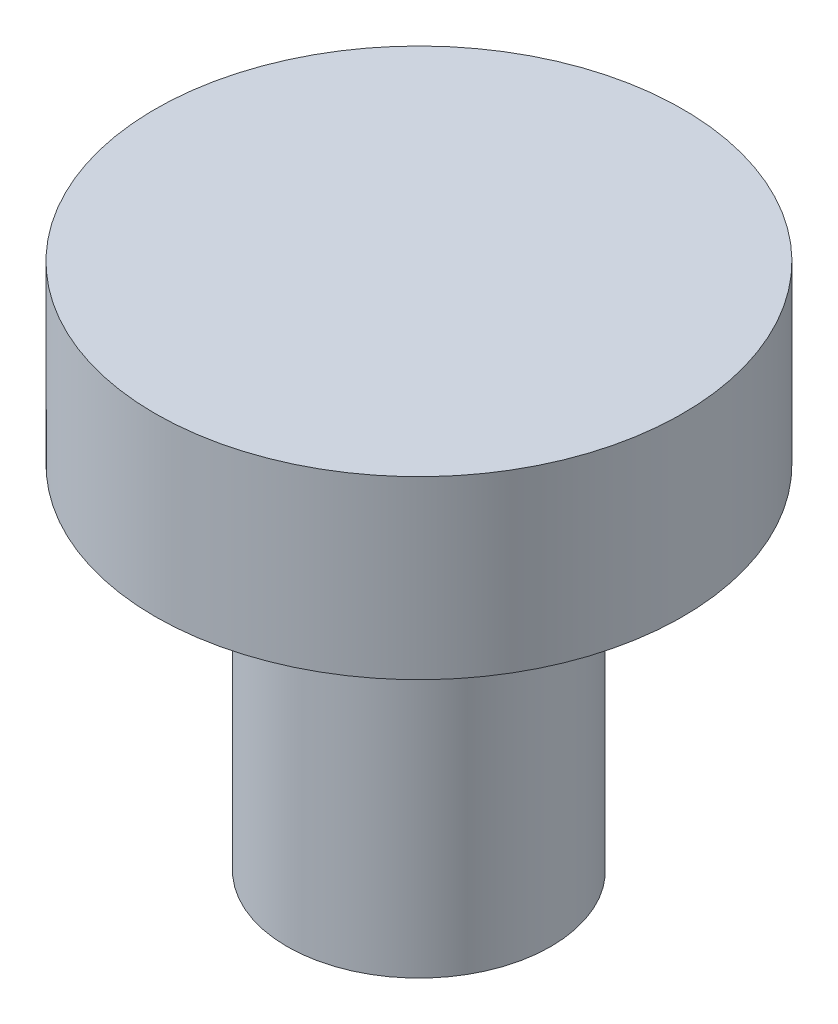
ISO-10303-21;
HEADER;
FILE_DESCRIPTION(('STEP AP214'),'2;1');
FILE_NAME('part.step','',(''),(''),'','','');
FILE_SCHEMA(('AUTOMOTIVE_DESIGN { 1 0 10303 214 1 1 1 1 }'));
ENDSEC;
DATA;
#1=APPLICATION_CONTEXT('core data for automotive mechanical design processes');
#2=APPLICATION_PROTOCOL_DEFINITION('international standard','automotive_design',2000,#1);
#3=PRODUCT_CONTEXT('',#1,'mechanical');
#4=PRODUCT('Part','Part','',(#3));
#5=PRODUCT_RELATED_PRODUCT_CATEGORY('part','',(#4));
#6=PRODUCT_DEFINITION_FORMATION('','',#4);
#7=PRODUCT_DEFINITION_CONTEXT('part definition',#1,'design');
#8=PRODUCT_DEFINITION('design','',#6,#7);
#9=PRODUCT_DEFINITION_SHAPE('','',#8);
#10=(LENGTH_UNIT() NAMED_UNIT(*) SI_UNIT(.MILLI.,.METRE.));
#11=(NAMED_UNIT(*) PLANE_ANGLE_UNIT() SI_UNIT($,.RADIAN.));
#12=(NAMED_UNIT(*) SI_UNIT($,.STERADIAN.) SOLID_ANGLE_UNIT());
#13=UNCERTAINTY_MEASURE_WITH_UNIT(LENGTH_MEASURE(1.E-05),#10,'distance_accuracy_value','');
#14=(GEOMETRIC_REPRESENTATION_CONTEXT(3) GLOBAL_UNCERTAINTY_ASSIGNED_CONTEXT((#13)) GLOBAL_UNIT_ASSIGNED_CONTEXT((#10,
#11,#12)) REPRESENTATION_CONTEXT('',''));
#15=CARTESIAN_POINT('',(0.,0.,0.));
#16=DIRECTION('',(0.,0.,1.));
#17=DIRECTION('',(1.,0.,0.));
#18=AXIS2_PLACEMENT_3D('',#15,#16,#17);
#19=CARTESIAN_POINT('',(0.,20.,0.));
#20=DIRECTION('',(0.,-1.,0.));
#21=DIRECTION('',(0.,0.,-1.));
#22=AXIS2_PLACEMENT_3D('',#19,#20,#21);
#23=CYLINDRICAL_SURFACE('',#22,7.5);
#24=CARTESIAN_POINT('',(0.,20.,0.));
#25=DIRECTION('',(0.,1.,0.));
#26=DIRECTION('',(0.,0.,1.));
#27=AXIS2_PLACEMENT_3D('',#24,#25,#26);
#28=CIRCLE('',#27,7.5);
#29=CARTESIAN_POINT('',(0.,20.,7.5));
#30=VERTEX_POINT('',#29);
#31=EDGE_CURVE('E10',#30,#30,#28,.T.);
#32=ORIENTED_EDGE('',*,*,#31,.F.);
#33=EDGE_LOOP('',(#32));
#34=FACE_BOUND('',#33,.T.);
#35=CARTESIAN_POINT('',(0.,0.,0.));
#36=DIRECTION('',(0.,1.,0.));
#37=DIRECTION('',(0.,0.,1.));
#38=AXIS2_PLACEMENT_3D('',#35,#36,#37);
#39=CIRCLE('',#38,7.5);
#40=CARTESIAN_POINT('',(0.,0.,7.5));
#41=VERTEX_POINT('',#40);
#42=EDGE_CURVE('E40',#41,#41,#39,.T.);
#43=ORIENTED_EDGE('',*,*,#42,.T.);
#44=EDGE_LOOP('',(#43));
#45=FACE_BOUND('',#44,.T.);
#46=ADVANCED_FACE('F37',(#34,#45),#23,.T.);
#47=CARTESIAN_POINT('',(0.,0.,0.));
#48=DIRECTION('',(0.,1.,0.));
#49=DIRECTION('',(0.,0.,1.));
#50=AXIS2_PLACEMENT_3D('',#47,#48,#49);
#51=PLANE('',#50);
#52=ORIENTED_EDGE('',*,*,#42,.F.);
#53=EDGE_LOOP('',(#52));
#54=FACE_BOUND('',#53,.T.);
#55=ADVANCED_FACE('F64',(#54),#51,.F.);
#56=CARTESIAN_POINT('',(0.,30.,0.));
#57=DIRECTION('',(0.,-1.,0.));
#58=DIRECTION('',(0.,0.,-1.));
#59=AXIS2_PLACEMENT_3D('',#56,#57,#58);
#60=CYLINDRICAL_SURFACE('',#59,15.);
#61=CARTESIAN_POINT('',(0.,30.,0.));
#62=DIRECTION('',(0.,1.,0.));
#63=DIRECTION('',(0.,0.,1.));
#64=AXIS2_PLACEMENT_3D('',#61,#62,#63);
#65=CIRCLE('',#64,15.);
#66=CARTESIAN_POINT('',(0.,30.,15.));
#67=VERTEX_POINT('',#66);
#68=EDGE_CURVE('E49',#67,#67,#65,.T.);
#69=ORIENTED_EDGE('',*,*,#68,.F.);
#70=EDGE_LOOP('',(#69));
#71=FACE_BOUND('',#70,.T.);
#72=CARTESIAN_POINT('',(0.,20.,0.));
#73=DIRECTION('',(0.,1.,0.));
#74=DIRECTION('',(0.,0.,1.));
#75=AXIS2_PLACEMENT_3D('',#72,#73,#74);
#76=CIRCLE('',#75,15.);
#77=CARTESIAN_POINT('',(0.,20.,15.));
#78=VERTEX_POINT('',#77);
#79=EDGE_CURVE('E51',#78,#78,#76,.T.);
#80=ORIENTED_EDGE('',*,*,#79,.T.);
#81=EDGE_LOOP('',(#80));
#82=FACE_BOUND('',#81,.T.);
#83=ADVANCED_FACE('F61',(#71,#82),#60,.T.);
#84=CARTESIAN_POINT('',(0.,30.,0.));
#85=DIRECTION('',(0.,1.,0.));
#86=DIRECTION('',(0.,0.,1.));
#87=AXIS2_PLACEMENT_3D('',#84,#85,#86);
#88=PLANE('',#87);
#89=ORIENTED_EDGE('',*,*,#68,.T.);
#90=EDGE_LOOP('',(#89));
#91=FACE_BOUND('',#90,.T.);
#92=ADVANCED_FACE('F59',(#91),#88,.T.);
#93=CARTESIAN_POINT('',(0.,20.,0.));
#94=DIRECTION('',(0.,1.,0.));
#95=DIRECTION('',(0.,0.,1.));
#96=AXIS2_PLACEMENT_3D('',#93,#94,#95);
#97=PLANE('',#96);
#98=ORIENTED_EDGE('',*,*,#31,.T.);
#99=EDGE_LOOP('',(#98));
#100=FACE_BOUND('',#99,.T.);
#101=ORIENTED_EDGE('',*,*,#79,.F.);
#102=EDGE_LOOP('',(#101));
#103=FACE_BOUND('',#102,.T.);
#104=ADVANCED_FACE('F68',(#100,#103),#97,.F.);
#105=CLOSED_SHELL('',(#46,#55,#83,#92,#104));
#106=MANIFOLD_SOLID_BREP('B2',#105);
#107=ADVANCED_BREP_SHAPE_REPRESENTATION('',(#18,#106),#14);
#108=SHAPE_DEFINITION_REPRESENTATION(#9,#107);
ENDSEC;
END-ISO-10303-21;
